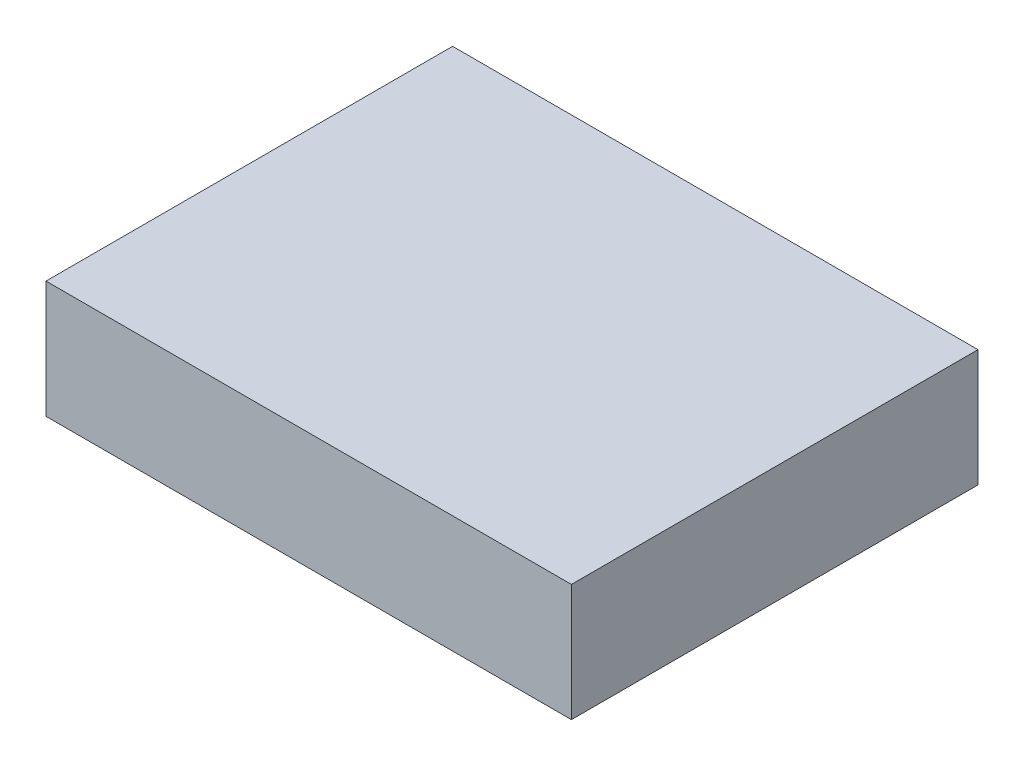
ISO-10303-21;
HEADER;
FILE_DESCRIPTION(('STEP AP214'),'2;1');
FILE_NAME('part.step','',(''),(''),'','','');
FILE_SCHEMA(('AUTOMOTIVE_DESIGN { 1 0 10303 214 1 1 1 1 }'));
ENDSEC;
DATA;
#1=APPLICATION_CONTEXT('core data for automotive mechanical design processes');
#2=APPLICATION_PROTOCOL_DEFINITION('international standard','automotive_design',2000,#1);
#3=PRODUCT_CONTEXT('',#1,'mechanical');
#4=PRODUCT('Part','Part','',(#3));
#5=PRODUCT_RELATED_PRODUCT_CATEGORY('part','',(#4));
#6=PRODUCT_DEFINITION_FORMATION('','',#4);
#7=PRODUCT_DEFINITION_CONTEXT('part definition',#1,'design');
#8=PRODUCT_DEFINITION('design','',#6,#7);
#9=PRODUCT_DEFINITION_SHAPE('','',#8);
#10=(LENGTH_UNIT() NAMED_UNIT(*) SI_UNIT(.MILLI.,.METRE.));
#11=(NAMED_UNIT(*) PLANE_ANGLE_UNIT() SI_UNIT($,.RADIAN.));
#12=(NAMED_UNIT(*) SI_UNIT($,.STERADIAN.) SOLID_ANGLE_UNIT());
#13=UNCERTAINTY_MEASURE_WITH_UNIT(LENGTH_MEASURE(1.E-05),#10,'distance_accuracy_value','');
#14=(GEOMETRIC_REPRESENTATION_CONTEXT(3) GLOBAL_UNCERTAINTY_ASSIGNED_CONTEXT((#13)) GLOBAL_UNIT_ASSIGNED_CONTEXT((#10,
#11,#12)) REPRESENTATION_CONTEXT('',''));
#15=CARTESIAN_POINT('',(0.,0.,0.));
#16=DIRECTION('',(0.,0.,1.));
#17=DIRECTION('',(1.,0.,0.));
#18=AXIS2_PLACEMENT_3D('',#15,#16,#17);
#19=CARTESIAN_POINT('',(0.,110.714415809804,6.72104540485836));
#20=DIRECTION('',(0.,-1.,0.));
#21=DIRECTION('',(0.,0.,-1.));
#22=AXIS2_PLACEMENT_3D('',#19,#20,#21);
#23=PLANE('',#22);
#24=DIRECTION('',(1.,0.,0.));
#25=VECTOR('',#24,1.);
#26=CARTESIAN_POINT('',(0.,110.714415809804,6.72104540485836));
#27=LINE('',#26,#25);
#28=CARTESIAN_POINT('',(-91.2963736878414,110.714415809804,6.72104540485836));
#29=VERTEX_POINT('',#28);
#30=CARTESIAN_POINT('',(91.2963736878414,110.714415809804,6.72104540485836));
#31=VERTEX_POINT('',#30);
#32=EDGE_CURVE('E68',#29,#31,#27,.T.);
#33=ORIENTED_EDGE('',*,*,#32,.T.);
#34=DIRECTION('',(0.,0.,-1.));
#35=VECTOR('',#34,1.);
#36=CARTESIAN_POINT('',(91.2963736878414,110.714415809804,6.72104540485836));
#37=LINE('',#36,#35);
#38=CARTESIAN_POINT('',(91.2963736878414,110.714415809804,148.026743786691));
#39=VERTEX_POINT('',#38);
#40=EDGE_CURVE('E55',#39,#31,#37,.T.);
#41=ORIENTED_EDGE('',*,*,#40,.F.);
#42=DIRECTION('',(1.,0.,0.));
#43=VECTOR('',#42,1.);
#44=CARTESIAN_POINT('',(0.,110.714415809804,148.026743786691));
#45=LINE('',#44,#43);
#46=CARTESIAN_POINT('',(-91.2963736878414,110.714415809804,148.026743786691));
#47=VERTEX_POINT('',#46);
#48=EDGE_CURVE('E20',#47,#39,#45,.T.);
#49=ORIENTED_EDGE('',*,*,#48,.F.);
#50=DIRECTION('',(0.,0.,1.));
#51=VECTOR('',#50,1.);
#52=CARTESIAN_POINT('',(-91.2963736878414,110.714415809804,6.72104540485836));
#53=LINE('',#52,#51);
#54=EDGE_CURVE('E81',#29,#47,#53,.T.);
#55=ORIENTED_EDGE('',*,*,#54,.F.);
#56=EDGE_LOOP('',(#33,#41,#49,#55));
#57=FACE_BOUND('',#56,.T.);
#58=ADVANCED_FACE('F17',(#57),#23,.T.);
#59=CARTESIAN_POINT('',(0.,131.071536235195,148.026743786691));
#60=DIRECTION('',(0.,0.,1.));
#61=DIRECTION('',(1.,0.,0.));
#62=AXIS2_PLACEMENT_3D('',#59,#60,#61);
#63=PLANE('',#62);
#64=DIRECTION('',(0.,1.,0.));
#65=VECTOR('',#64,1.);
#66=CARTESIAN_POINT('',(91.2963736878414,131.071536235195,148.026743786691));
#67=LINE('',#66,#65);
#68=CARTESIAN_POINT('',(91.2963736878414,151.428656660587,148.026743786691));
#69=VERTEX_POINT('',#68);
#70=EDGE_CURVE('E61',#69,#39,#67,.F.);
#71=ORIENTED_EDGE('',*,*,#70,.F.);
#72=DIRECTION('',(1.,0.,0.));
#73=VECTOR('',#72,1.);
#74=CARTESIAN_POINT('',(0.,151.428656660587,148.026743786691));
#75=LINE('',#74,#73);
#76=CARTESIAN_POINT('',(-91.2963736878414,151.428656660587,148.026743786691));
#77=VERTEX_POINT('',#76);
#78=EDGE_CURVE('E83',#77,#69,#75,.T.);
#79=ORIENTED_EDGE('',*,*,#78,.F.);
#80=DIRECTION('',(0.,1.,0.));
#81=VECTOR('',#80,1.);
#82=CARTESIAN_POINT('',(-91.2963736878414,131.071536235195,148.026743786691));
#83=LINE('',#82,#81);
#84=EDGE_CURVE('E64',#47,#77,#83,.T.);
#85=ORIENTED_EDGE('',*,*,#84,.F.);
#86=ORIENTED_EDGE('',*,*,#48,.T.);
#87=EDGE_LOOP('',(#71,#79,#85,#86));
#88=FACE_BOUND('',#87,.T.);
#89=ADVANCED_FACE('F60',(#88),#63,.T.);
#90=CARTESIAN_POINT('',(91.2963736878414,131.071536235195,6.72104540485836));
#91=DIRECTION('',(1.,0.,0.));
#92=DIRECTION('',(0.,0.,-1.));
#93=AXIS2_PLACEMENT_3D('',#90,#91,#92);
#94=PLANE('',#93);
#95=DIRECTION('',(0.,1.,0.));
#96=VECTOR('',#95,1.);
#97=CARTESIAN_POINT('',(91.2963736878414,131.071536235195,6.72104540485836));
#98=LINE('',#97,#96);
#99=CARTESIAN_POINT('',(91.2963736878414,151.428656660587,6.72104540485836));
#100=VERTEX_POINT('',#99);
#101=EDGE_CURVE('E70',#31,#100,#98,.T.);
#102=ORIENTED_EDGE('',*,*,#101,.T.);
#103=DIRECTION('',(0.,0.,1.));
#104=VECTOR('',#103,1.);
#105=CARTESIAN_POINT('',(91.2963736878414,151.428656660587,6.72104540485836));
#106=LINE('',#105,#104);
#107=EDGE_CURVE('E74',#69,#100,#106,.F.);
#108=ORIENTED_EDGE('',*,*,#107,.F.);
#109=ORIENTED_EDGE('',*,*,#70,.T.);
#110=ORIENTED_EDGE('',*,*,#40,.T.);
#111=EDGE_LOOP('',(#102,#108,#109,#110));
#112=FACE_BOUND('',#111,.T.);
#113=ADVANCED_FACE('F72',(#112),#94,.T.);
#114=CARTESIAN_POINT('',(0.,131.071536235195,6.72104540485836));
#115=DIRECTION('',(0.,0.,1.));
#116=DIRECTION('',(1.,0.,0.));
#117=AXIS2_PLACEMENT_3D('',#114,#115,#116);
#118=PLANE('',#117);
#119=DIRECTION('',(0.,1.,0.));
#120=VECTOR('',#119,1.);
#121=CARTESIAN_POINT('',(-91.2963736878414,131.071536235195,6.72104540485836));
#122=LINE('',#121,#120);
#123=CARTESIAN_POINT('',(-91.2963736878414,151.428656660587,6.72104540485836));
#124=VERTEX_POINT('',#123);
#125=EDGE_CURVE('E35',#124,#29,#122,.F.);
#126=ORIENTED_EDGE('',*,*,#125,.F.);
#127=DIRECTION('',(1.,0.,0.));
#128=VECTOR('',#127,1.);
#129=CARTESIAN_POINT('',(0.,151.428656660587,6.72104540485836));
#130=LINE('',#129,#128);
#131=EDGE_CURVE('E26',#100,#124,#130,.F.);
#132=ORIENTED_EDGE('',*,*,#131,.F.);
#133=ORIENTED_EDGE('',*,*,#101,.F.);
#134=ORIENTED_EDGE('',*,*,#32,.F.);
#135=EDGE_LOOP('',(#126,#132,#133,#134));
#136=FACE_BOUND('',#135,.T.);
#137=ADVANCED_FACE('F89',(#136),#118,.F.);
#138=CARTESIAN_POINT('',(-91.2963736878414,131.071536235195,6.72104540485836));
#139=DIRECTION('',(-1.,0.,0.));
#140=DIRECTION('',(0.,0.,1.));
#141=AXIS2_PLACEMENT_3D('',#138,#139,#140);
#142=PLANE('',#141);
#143=ORIENTED_EDGE('',*,*,#125,.T.);
#144=ORIENTED_EDGE('',*,*,#54,.T.);
#145=ORIENTED_EDGE('',*,*,#84,.T.);
#146=DIRECTION('',(0.,0.,1.));
#147=VECTOR('',#146,1.);
#148=CARTESIAN_POINT('',(-91.2963736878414,151.428656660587,6.72104540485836));
#149=LINE('',#148,#147);
#150=EDGE_CURVE('E11',#124,#77,#149,.T.);
#151=ORIENTED_EDGE('',*,*,#150,.F.);
#152=EDGE_LOOP('',(#143,#144,#145,#151));
#153=FACE_BOUND('',#152,.T.);
#154=ADVANCED_FACE('F91',(#153),#142,.T.);
#155=CARTESIAN_POINT('',(0.,151.428656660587,6.72104540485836));
#156=DIRECTION('',(0.,1.,0.));
#157=DIRECTION('',(0.,0.,1.));
#158=AXIS2_PLACEMENT_3D('',#155,#156,#157);
#159=PLANE('',#158);
#160=ORIENTED_EDGE('',*,*,#131,.T.);
#161=ORIENTED_EDGE('',*,*,#150,.T.);
#162=ORIENTED_EDGE('',*,*,#78,.T.);
#163=ORIENTED_EDGE('',*,*,#107,.T.);
#164=EDGE_LOOP('',(#160,#161,#162,#163));
#165=FACE_BOUND('',#164,.T.);
#166=ADVANCED_FACE('F88',(#165),#159,.T.);
#167=CLOSED_SHELL('',(#58,#89,#113,#137,#154,#166));
#168=MANIFOLD_SOLID_BREP('B1',#167);
#169=ADVANCED_BREP_SHAPE_REPRESENTATION('',(#18,#168),#14);
#170=SHAPE_DEFINITION_REPRESENTATION(#9,#169);
ENDSEC;
END-ISO-10303-21;
